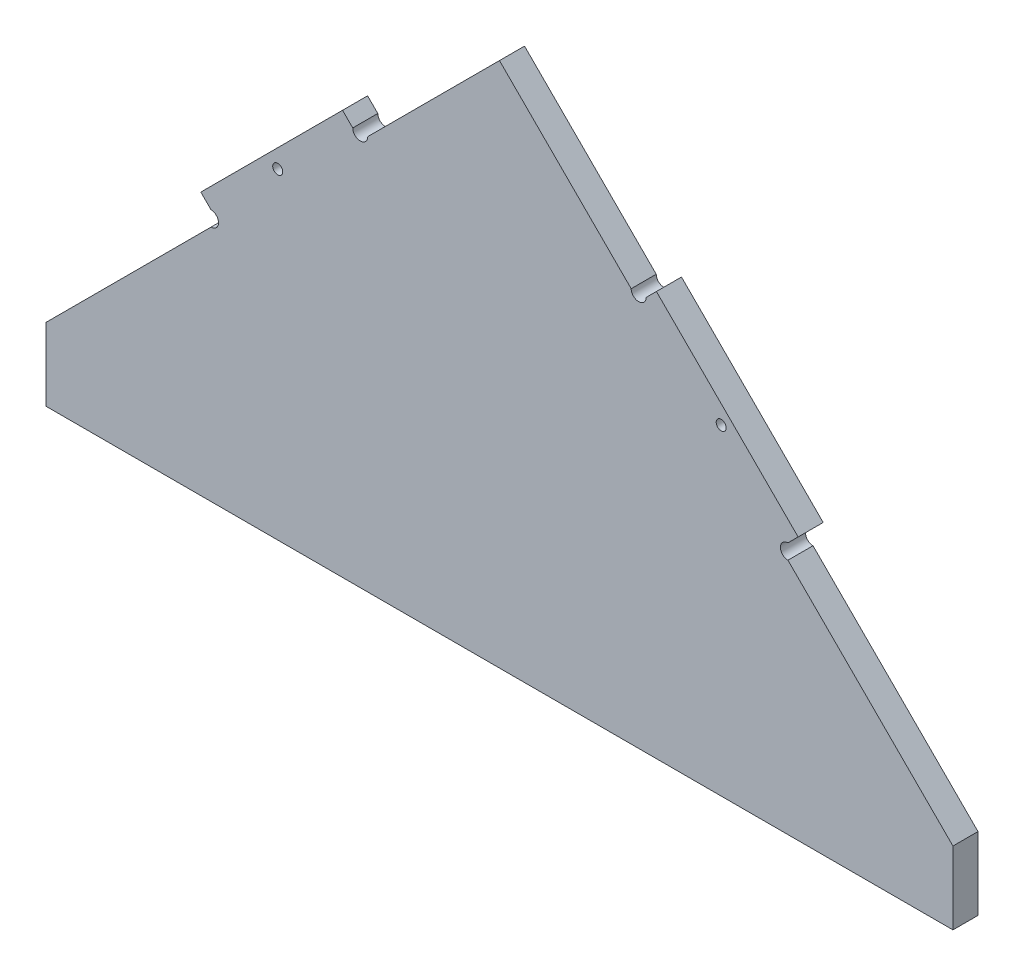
ISO-10303-21;
HEADER;
FILE_DESCRIPTION(('STEP AP214'),'2;1');
FILE_NAME('part.step','',(''),(''),'','','');
FILE_SCHEMA(('AUTOMOTIVE_DESIGN { 1 0 10303 214 1 1 1 1 }'));
ENDSEC;
DATA;
#1=APPLICATION_CONTEXT('core data for automotive mechanical design processes');
#2=APPLICATION_PROTOCOL_DEFINITION('international standard','automotive_design',2000,#1);
#3=PRODUCT_CONTEXT('',#1,'mechanical');
#4=PRODUCT('Part','Part','',(#3));
#5=PRODUCT_RELATED_PRODUCT_CATEGORY('part','',(#4));
#6=PRODUCT_DEFINITION_FORMATION('','',#4);
#7=PRODUCT_DEFINITION_CONTEXT('part definition',#1,'design');
#8=PRODUCT_DEFINITION('design','',#6,#7);
#9=PRODUCT_DEFINITION_SHAPE('','',#8);
#10=(LENGTH_UNIT() NAMED_UNIT(*) SI_UNIT(.MILLI.,.METRE.));
#11=(NAMED_UNIT(*) PLANE_ANGLE_UNIT() SI_UNIT($,.RADIAN.));
#12=(NAMED_UNIT(*) SI_UNIT($,.STERADIAN.) SOLID_ANGLE_UNIT());
#13=UNCERTAINTY_MEASURE_WITH_UNIT(LENGTH_MEASURE(1.E-05),#10,'distance_accuracy_value','');
#14=(GEOMETRIC_REPRESENTATION_CONTEXT(3) GLOBAL_UNCERTAINTY_ASSIGNED_CONTEXT((#13)) GLOBAL_UNIT_ASSIGNED_CONTEXT((#10,
#11,#12)) REPRESENTATION_CONTEXT('',''));
#15=CARTESIAN_POINT('',(0.,0.,0.));
#16=DIRECTION('',(0.,0.,1.));
#17=DIRECTION('',(1.,0.,0.));
#18=AXIS2_PLACEMENT_3D('',#15,#16,#17);
#19=CARTESIAN_POINT('',(-57.568542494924,48.9314575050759,5.));
#20=DIRECTION('',(0.,0.,-1.));
#21=DIRECTION('',(-1.,0.,0.));
#22=AXIS2_PLACEMENT_3D('',#19,#20,#21);
#23=PLANE('',#22);
#24=CARTESIAN_POINT('',(-44.2533933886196,64.1223634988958,5.));
#25=DIRECTION('',(0.,0.,1.));
#26=DIRECTION('',(-1.,0.,0.));
#27=AXIS2_PLACEMENT_3D('',#24,#25,#26);
#28=CIRCLE('',#27,1.00000000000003);
#29=CARTESIAN_POINT('',(-45.2533933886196,64.1223634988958,5.));
#30=VERTEX_POINT('',#29);
#31=EDGE_CURVE('E187',#30,#30,#28,.T.);
#32=ORIENTED_EDGE('',*,*,#31,.F.);
#33=EDGE_LOOP('',(#32));
#34=FACE_BOUND('',#33,.T.);
#35=DIRECTION('',(-0.707106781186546,0.707106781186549,0.));
#36=VECTOR('',#35,1.);
#37=CARTESIAN_POINT('',(-29.2842712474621,78.7157287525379,5.));
#38=LINE('',#37,#36);
#39=CARTESIAN_POINT('',(-29.2842712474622,78.7157287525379,5.));
#40=VERTEX_POINT('',#39);
#41=CARTESIAN_POINT('',(-31.3198051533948,80.7512626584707,5.));
#42=VERTEX_POINT('',#41);
#43=EDGE_CURVE('E216',#40,#42,#38,.T.);
#44=ORIENTED_EDGE('',*,*,#43,.T.);
#45=DIRECTION('',(-0.707106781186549,-0.707106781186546,0.));
#46=VECTOR('',#45,1.);
#47=CARTESIAN_POINT('',(-31.3198051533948,80.7512626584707,5.));
#48=LINE('',#47,#46);
#49=CARTESIAN_POINT('',(-59.6040764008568,52.4669914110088,5.));
#50=VERTEX_POINT('',#49);
#51=EDGE_CURVE('E119',#42,#50,#48,.T.);
#52=ORIENTED_EDGE('',*,*,#51,.T.);
#53=DIRECTION('',(0.70710678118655,-0.707106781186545,0.));
#54=VECTOR('',#53,1.);
#55=CARTESIAN_POINT('',(-59.6040764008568,52.4669914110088,5.));
#56=LINE('',#55,#54);
#57=CARTESIAN_POINT('',(-57.5685424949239,50.4314575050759,5.));
#58=VERTEX_POINT('',#57);
#59=EDGE_CURVE('E258',#50,#58,#56,.T.);
#60=ORIENTED_EDGE('',*,*,#59,.T.);
#61=CARTESIAN_POINT('',(-57.568542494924,48.9314575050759,5.));
#62=DIRECTION('',(0.,0.,-1.));
#63=DIRECTION('',(-1.,0.,0.));
#64=AXIS2_PLACEMENT_3D('',#61,#62,#63);
#65=CIRCLE('',#64,1.5);
#66=CARTESIAN_POINT('',(-57.568542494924,47.4314575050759,5.));
#67=VERTEX_POINT('',#66);
#68=EDGE_CURVE('E277',#58,#67,#65,.T.);
#69=ORIENTED_EDGE('',*,*,#68,.T.);
#70=DIRECTION('',(-0.70710678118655,-0.707106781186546,0.));
#71=VECTOR('',#70,1.);
#72=CARTESIAN_POINT('',(-90.5,14.5,5.));
#73=LINE('',#72,#71);
#74=CARTESIAN_POINT('',(-90.5,14.5,5.));
#75=VERTEX_POINT('',#74);
#76=EDGE_CURVE('E274',#67,#75,#73,.T.);
#77=ORIENTED_EDGE('',*,*,#76,.T.);
#78=DIRECTION('',(0.,-1.,0.));
#79=VECTOR('',#78,1.);
#80=CARTESIAN_POINT('',(-90.5,0.,5.));
#81=LINE('',#80,#79);
#82=CARTESIAN_POINT('',(-90.5,0.,5.));
#83=VERTEX_POINT('',#82);
#84=EDGE_CURVE('E276',#75,#83,#81,.T.);
#85=ORIENTED_EDGE('',*,*,#84,.T.);
#86=DIRECTION('',(1.,0.,0.));
#87=VECTOR('',#86,1.);
#88=CARTESIAN_POINT('',(90.5,0.,5.));
#89=LINE('',#88,#87);
#90=CARTESIAN_POINT('',(90.5,0.,5.));
#91=VERTEX_POINT('',#90);
#92=EDGE_CURVE('E279',#83,#91,#89,.T.);
#93=ORIENTED_EDGE('',*,*,#92,.T.);
#94=DIRECTION('',(0.,1.,0.));
#95=VECTOR('',#94,1.);
#96=CARTESIAN_POINT('',(90.5,0.,5.));
#97=LINE('',#96,#95);
#98=CARTESIAN_POINT('',(90.5000000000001,14.5,5.));
#99=VERTEX_POINT('',#98);
#100=EDGE_CURVE('E285',#91,#99,#97,.T.);
#101=ORIENTED_EDGE('',*,*,#100,.T.);
#102=DIRECTION('',(-0.70710678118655,0.707106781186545,0.));
#103=VECTOR('',#102,1.);
#104=CARTESIAN_POINT('',(90.5000000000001,14.5,5.));
#105=LINE('',#104,#103);
#106=CARTESIAN_POINT('',(57.568542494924,47.4314575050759,5.));
#107=VERTEX_POINT('',#106);
#108=EDGE_CURVE('E287',#99,#107,#105,.T.);
#109=ORIENTED_EDGE('',*,*,#108,.T.);
#110=CARTESIAN_POINT('',(57.568542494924,48.9314575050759,5.));
#111=DIRECTION('',(0.,0.,-1.));
#112=DIRECTION('',(1.,0.,0.));
#113=AXIS2_PLACEMENT_3D('',#110,#111,#112);
#114=CIRCLE('',#113,1.5);
#115=CARTESIAN_POINT('',(57.5685424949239,50.4314575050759,5.));
#116=VERTEX_POINT('',#115);
#117=EDGE_CURVE('E289',#107,#116,#114,.T.);
#118=ORIENTED_EDGE('',*,*,#117,.T.);
#119=DIRECTION('',(0.707106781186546,0.707106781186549,0.));
#120=VECTOR('',#119,1.);
#121=CARTESIAN_POINT('',(59.6040764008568,52.4669914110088,5.));
#122=LINE('',#121,#120);
#123=CARTESIAN_POINT('',(59.6040764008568,52.4669914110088,5.));
#124=VERTEX_POINT('',#123);
#125=EDGE_CURVE('E291',#116,#124,#122,.T.);
#126=ORIENTED_EDGE('',*,*,#125,.T.);
#127=DIRECTION('',(-0.707106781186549,0.707106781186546,0.));
#128=VECTOR('',#127,1.);
#129=CARTESIAN_POINT('',(31.3198051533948,80.7512626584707,5.));
#130=LINE('',#129,#128);
#131=CARTESIAN_POINT('',(31.3198051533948,80.7512626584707,5.));
#132=VERTEX_POINT('',#131);
#133=EDGE_CURVE('E293',#124,#132,#130,.T.);
#134=ORIENTED_EDGE('',*,*,#133,.T.);
#135=DIRECTION('',(-0.707106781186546,-0.707106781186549,0.));
#136=VECTOR('',#135,1.);
#137=CARTESIAN_POINT('',(29.2842712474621,78.7157287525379,5.));
#138=LINE('',#137,#136);
#139=CARTESIAN_POINT('',(29.2842712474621,78.7157287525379,5.));
#140=VERTEX_POINT('',#139);
#141=EDGE_CURVE('E295',#132,#140,#138,.T.);
#142=ORIENTED_EDGE('',*,*,#141,.T.);
#143=CARTESIAN_POINT('',(27.784271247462,78.7157287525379,5.));
#144=DIRECTION('',(0.,0.,-1.));
#145=DIRECTION('',(1.,0.,0.));
#146=AXIS2_PLACEMENT_3D('',#143,#144,#145);
#147=CIRCLE('',#146,1.50000000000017);
#148=CARTESIAN_POINT('',(26.2842712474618,78.7157287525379,5.));
#149=VERTEX_POINT('',#148);
#150=EDGE_CURVE('E165',#140,#149,#147,.T.);
#151=ORIENTED_EDGE('',*,*,#150,.T.);
#152=DIRECTION('',(-0.70710678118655,0.707106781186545,0.));
#153=VECTOR('',#152,1.);
#154=CARTESIAN_POINT('',(26.2842712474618,78.7157287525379,5.));
#155=LINE('',#154,#153);
#156=CARTESIAN_POINT('',(0.,105.,5.));
#157=VERTEX_POINT('',#156);
#158=EDGE_CURVE('E159',#149,#157,#155,.T.);
#159=ORIENTED_EDGE('',*,*,#158,.T.);
#160=DIRECTION('',(-0.707106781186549,-0.707106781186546,0.));
#161=VECTOR('',#160,1.);
#162=CARTESIAN_POINT('',(-26.2842712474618,78.7157287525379,5.));
#163=LINE('',#162,#161);
#164=CARTESIAN_POINT('',(-26.2842712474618,78.7157287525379,5.));
#165=VERTEX_POINT('',#164);
#166=EDGE_CURVE('E163',#157,#165,#163,.T.);
#167=ORIENTED_EDGE('',*,*,#166,.T.);
#168=CARTESIAN_POINT('',(-27.784271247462,78.7157287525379,5.));
#169=DIRECTION('',(0.,0.,-1.));
#170=DIRECTION('',(-1.,0.,0.));
#171=AXIS2_PLACEMENT_3D('',#168,#169,#170);
#172=CIRCLE('',#171,1.50000000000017);
#173=EDGE_CURVE('E49',#165,#40,#172,.T.);
#174=ORIENTED_EDGE('',*,*,#173,.T.);
#175=EDGE_LOOP('',(#44,#52,#60,#69,#77,#85,#93,#101,#109,#118,#126,#134,#142,#151,#159,#167,#174));
#176=FACE_BOUND('',#175,.T.);
#177=CARTESIAN_POINT('',(44.2533933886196,64.1223634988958,5.));
#178=DIRECTION('',(0.,0.,1.));
#179=DIRECTION('',(1.,0.,0.));
#180=AXIS2_PLACEMENT_3D('',#177,#178,#179);
#181=CIRCLE('',#180,1.00000000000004);
#182=CARTESIAN_POINT('',(45.2533933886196,64.1223634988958,5.));
#183=VERTEX_POINT('',#182);
#184=EDGE_CURVE('E338',#183,#183,#181,.T.);
#185=ORIENTED_EDGE('',*,*,#184,.F.);
#186=EDGE_LOOP('',(#185));
#187=FACE_BOUND('',#186,.T.);
#188=ADVANCED_FACE('F32',(#34,#176,#187),#23,.F.);
#189=CARTESIAN_POINT('',(-57.568542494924,48.9314575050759,0.));
#190=DIRECTION('',(0.,0.,-1.));
#191=DIRECTION('',(-1.,0.,0.));
#192=AXIS2_PLACEMENT_3D('',#189,#190,#191);
#193=PLANE('',#192);
#194=CARTESIAN_POINT('',(-44.2533933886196,64.1223634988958,0.));
#195=DIRECTION('',(0.,0.,1.));
#196=DIRECTION('',(-1.,0.,0.));
#197=AXIS2_PLACEMENT_3D('',#194,#195,#196);
#198=CIRCLE('',#197,1.00000000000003);
#199=CARTESIAN_POINT('',(-45.2533933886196,64.1223634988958,0.));
#200=VERTEX_POINT('',#199);
#201=EDGE_CURVE('E343',#200,#200,#198,.T.);
#202=ORIENTED_EDGE('',*,*,#201,.T.);
#203=EDGE_LOOP('',(#202));
#204=FACE_BOUND('',#203,.T.);
#205=DIRECTION('',(-0.707106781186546,0.707106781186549,0.));
#206=VECTOR('',#205,1.);
#207=CARTESIAN_POINT('',(-29.2842712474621,78.7157287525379,0.));
#208=LINE('',#207,#206);
#209=CARTESIAN_POINT('',(-29.2842712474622,78.7157287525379,0.));
#210=VERTEX_POINT('',#209);
#211=CARTESIAN_POINT('',(-31.3198051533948,80.7512626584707,0.));
#212=VERTEX_POINT('',#211);
#213=EDGE_CURVE('E183',#210,#212,#208,.T.);
#214=ORIENTED_EDGE('',*,*,#213,.F.);
#215=CARTESIAN_POINT('',(-27.784271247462,78.7157287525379,0.));
#216=DIRECTION('',(0.,0.,-1.));
#217=DIRECTION('',(-1.,0.,0.));
#218=AXIS2_PLACEMENT_3D('',#215,#216,#217);
#219=CIRCLE('',#218,1.50000000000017);
#220=CARTESIAN_POINT('',(-26.2842712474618,78.7157287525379,0.));
#221=VERTEX_POINT('',#220);
#222=EDGE_CURVE('E111',#221,#210,#219,.T.);
#223=ORIENTED_EDGE('',*,*,#222,.F.);
#224=DIRECTION('',(-0.707106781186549,-0.707106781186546,0.));
#225=VECTOR('',#224,1.);
#226=CARTESIAN_POINT('',(-26.2842712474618,78.7157287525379,0.));
#227=LINE('',#226,#225);
#228=CARTESIAN_POINT('',(0.,105.,0.));
#229=VERTEX_POINT('',#228);
#230=EDGE_CURVE('E105',#229,#221,#227,.T.);
#231=ORIENTED_EDGE('',*,*,#230,.F.);
#232=DIRECTION('',(-0.70710678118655,0.707106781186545,0.));
#233=VECTOR('',#232,1.);
#234=CARTESIAN_POINT('',(26.2842712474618,78.7157287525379,0.));
#235=LINE('',#234,#233);
#236=CARTESIAN_POINT('',(26.2842712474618,78.7157287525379,0.));
#237=VERTEX_POINT('',#236);
#238=EDGE_CURVE('E173',#237,#229,#235,.T.);
#239=ORIENTED_EDGE('',*,*,#238,.F.);
#240=CARTESIAN_POINT('',(27.784271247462,78.7157287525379,0.));
#241=DIRECTION('',(0.,0.,-1.));
#242=DIRECTION('',(1.,0.,0.));
#243=AXIS2_PLACEMENT_3D('',#240,#241,#242);
#244=CIRCLE('',#243,1.50000000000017);
#245=CARTESIAN_POINT('',(29.2842712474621,78.7157287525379,0.));
#246=VERTEX_POINT('',#245);
#247=EDGE_CURVE('E211',#246,#237,#244,.T.);
#248=ORIENTED_EDGE('',*,*,#247,.F.);
#249=DIRECTION('',(-0.707106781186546,-0.707106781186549,0.));
#250=VECTOR('',#249,1.);
#251=CARTESIAN_POINT('',(29.2842712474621,78.7157287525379,0.));
#252=LINE('',#251,#250);
#253=CARTESIAN_POINT('',(31.3198051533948,80.7512626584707,0.));
#254=VERTEX_POINT('',#253);
#255=EDGE_CURVE('E209',#254,#246,#252,.T.);
#256=ORIENTED_EDGE('',*,*,#255,.F.);
#257=DIRECTION('',(-0.707106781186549,0.707106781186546,0.));
#258=VECTOR('',#257,1.);
#259=CARTESIAN_POINT('',(31.3198051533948,80.7512626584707,0.));
#260=LINE('',#259,#258);
#261=CARTESIAN_POINT('',(59.6040764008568,52.4669914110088,0.));
#262=VERTEX_POINT('',#261);
#263=EDGE_CURVE('E207',#262,#254,#260,.T.);
#264=ORIENTED_EDGE('',*,*,#263,.F.);
#265=DIRECTION('',(0.707106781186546,0.707106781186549,0.));
#266=VECTOR('',#265,1.);
#267=CARTESIAN_POINT('',(59.6040764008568,52.4669914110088,0.));
#268=LINE('',#267,#266);
#269=CARTESIAN_POINT('',(57.5685424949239,50.4314575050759,0.));
#270=VERTEX_POINT('',#269);
#271=EDGE_CURVE('E205',#270,#262,#268,.T.);
#272=ORIENTED_EDGE('',*,*,#271,.F.);
#273=CARTESIAN_POINT('',(57.568542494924,48.9314575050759,0.));
#274=DIRECTION('',(0.,0.,-1.));
#275=DIRECTION('',(1.,0.,0.));
#276=AXIS2_PLACEMENT_3D('',#273,#274,#275);
#277=CIRCLE('',#276,1.5);
#278=CARTESIAN_POINT('',(57.568542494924,47.4314575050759,0.));
#279=VERTEX_POINT('',#278);
#280=EDGE_CURVE('E203',#279,#270,#277,.T.);
#281=ORIENTED_EDGE('',*,*,#280,.F.);
#282=DIRECTION('',(-0.70710678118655,0.707106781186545,0.));
#283=VECTOR('',#282,1.);
#284=CARTESIAN_POINT('',(90.5000000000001,14.5,0.));
#285=LINE('',#284,#283);
#286=CARTESIAN_POINT('',(90.5000000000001,14.5,0.));
#287=VERTEX_POINT('',#286);
#288=EDGE_CURVE('E201',#287,#279,#285,.T.);
#289=ORIENTED_EDGE('',*,*,#288,.F.);
#290=DIRECTION('',(0.,1.,0.));
#291=VECTOR('',#290,1.);
#292=CARTESIAN_POINT('',(90.5,0.,0.));
#293=LINE('',#292,#291);
#294=CARTESIAN_POINT('',(90.5,0.,0.));
#295=VERTEX_POINT('',#294);
#296=EDGE_CURVE('E199',#295,#287,#293,.T.);
#297=ORIENTED_EDGE('',*,*,#296,.F.);
#298=DIRECTION('',(1.,0.,0.));
#299=VECTOR('',#298,1.);
#300=CARTESIAN_POINT('',(90.5,0.,0.));
#301=LINE('',#300,#299);
#302=CARTESIAN_POINT('',(-90.5,0.,0.));
#303=VERTEX_POINT('',#302);
#304=EDGE_CURVE('E197',#303,#295,#301,.T.);
#305=ORIENTED_EDGE('',*,*,#304,.F.);
#306=DIRECTION('',(0.,-1.,0.));
#307=VECTOR('',#306,1.);
#308=CARTESIAN_POINT('',(-90.5,0.,0.));
#309=LINE('',#308,#307);
#310=CARTESIAN_POINT('',(-90.5,14.5,0.));
#311=VERTEX_POINT('',#310);
#312=EDGE_CURVE('E195',#311,#303,#309,.T.);
#313=ORIENTED_EDGE('',*,*,#312,.F.);
#314=DIRECTION('',(-0.70710678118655,-0.707106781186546,0.));
#315=VECTOR('',#314,1.);
#316=CARTESIAN_POINT('',(-90.5,14.5,0.));
#317=LINE('',#316,#315);
#318=CARTESIAN_POINT('',(-57.568542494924,47.4314575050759,0.));
#319=VERTEX_POINT('',#318);
#320=EDGE_CURVE('E193',#319,#311,#317,.T.);
#321=ORIENTED_EDGE('',*,*,#320,.F.);
#322=CARTESIAN_POINT('',(-57.568542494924,48.9314575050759,0.));
#323=DIRECTION('',(0.,0.,-1.));
#324=DIRECTION('',(-1.,0.,0.));
#325=AXIS2_PLACEMENT_3D('',#322,#323,#324);
#326=CIRCLE('',#325,1.5);
#327=CARTESIAN_POINT('',(-57.5685424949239,50.4314575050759,0.));
#328=VERTEX_POINT('',#327);
#329=EDGE_CURVE('E191',#328,#319,#326,.T.);
#330=ORIENTED_EDGE('',*,*,#329,.F.);
#331=DIRECTION('',(0.70710678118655,-0.707106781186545,0.));
#332=VECTOR('',#331,1.);
#333=CARTESIAN_POINT('',(-59.6040764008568,52.4669914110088,0.));
#334=LINE('',#333,#332);
#335=CARTESIAN_POINT('',(-59.6040764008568,52.4669914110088,0.));
#336=VERTEX_POINT('',#335);
#337=EDGE_CURVE('E189',#336,#328,#334,.T.);
#338=ORIENTED_EDGE('',*,*,#337,.F.);
#339=DIRECTION('',(-0.707106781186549,-0.707106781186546,0.));
#340=VECTOR('',#339,1.);
#341=CARTESIAN_POINT('',(-31.3198051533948,80.7512626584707,0.));
#342=LINE('',#341,#340);
#343=EDGE_CURVE('E186',#212,#336,#342,.T.);
#344=ORIENTED_EDGE('',*,*,#343,.F.);
#345=EDGE_LOOP('',(#214,#223,#231,#239,#248,#256,#264,#272,#281,#289,#297,#305,#313,#321,#330,
#338,#344));
#346=FACE_BOUND('',#345,.T.);
#347=CARTESIAN_POINT('',(44.2533933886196,64.1223634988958,0.));
#348=DIRECTION('',(0.,0.,1.));
#349=DIRECTION('',(1.,0.,0.));
#350=AXIS2_PLACEMENT_3D('',#347,#348,#349);
#351=CIRCLE('',#350,1.00000000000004);
#352=CARTESIAN_POINT('',(45.2533933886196,64.1223634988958,0.));
#353=VERTEX_POINT('',#352);
#354=EDGE_CURVE('E341',#353,#353,#351,.T.);
#355=ORIENTED_EDGE('',*,*,#354,.T.);
#356=EDGE_LOOP('',(#355));
#357=FACE_BOUND('',#356,.T.);
#358=ADVANCED_FACE('F262',(#204,#346,#357),#193,.T.);
#359=CARTESIAN_POINT('',(-29.2842712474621,78.7157287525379,5.));
#360=DIRECTION('',(-0.707106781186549,-0.707106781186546,0.));
#361=DIRECTION('',(0.707106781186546,-0.707106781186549,0.));
#362=AXIS2_PLACEMENT_3D('',#359,#360,#361);
#363=PLANE('',#362);
#364=ORIENTED_EDGE('',*,*,#213,.T.);
#365=DIRECTION('',(0.,0.,-1.));
#366=VECTOR('',#365,1.);
#367=CARTESIAN_POINT('',(-31.3198051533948,80.7512626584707,5.));
#368=LINE('',#367,#366);
#369=EDGE_CURVE('E11',#42,#212,#368,.T.);
#370=ORIENTED_EDGE('',*,*,#369,.F.);
#371=ORIENTED_EDGE('',*,*,#43,.F.);
#372=DIRECTION('',(0.,0.,-1.));
#373=VECTOR('',#372,1.);
#374=CARTESIAN_POINT('',(-29.2842712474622,78.7157287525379,5.));
#375=LINE('',#374,#373);
#376=EDGE_CURVE('E179',#40,#210,#375,.T.);
#377=ORIENTED_EDGE('',*,*,#376,.T.);
#378=EDGE_LOOP('',(#364,#370,#371,#377));
#379=FACE_BOUND('',#378,.T.);
#380=ADVANCED_FACE('F34',(#379),#363,.F.);
#381=CARTESIAN_POINT('',(-31.3198051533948,80.7512626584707,5.));
#382=DIRECTION('',(0.707106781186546,-0.707106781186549,0.));
#383=DIRECTION('',(0.707106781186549,0.707106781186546,0.));
#384=AXIS2_PLACEMENT_3D('',#381,#382,#383);
#385=PLANE('',#384);
#386=ORIENTED_EDGE('',*,*,#343,.T.);
#387=DIRECTION('',(0.,0.,-1.));
#388=VECTOR('',#387,1.);
#389=CARTESIAN_POINT('',(-59.6040764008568,52.4669914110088,5.));
#390=LINE('',#389,#388);
#391=EDGE_CURVE('E41',#50,#336,#390,.T.);
#392=ORIENTED_EDGE('',*,*,#391,.F.);
#393=ORIENTED_EDGE('',*,*,#51,.F.);
#394=ORIENTED_EDGE('',*,*,#369,.T.);
#395=EDGE_LOOP('',(#386,#392,#393,#394));
#396=FACE_BOUND('',#395,.T.);
#397=ADVANCED_FACE('F486',(#396),#385,.F.);
#398=CARTESIAN_POINT('',(-59.6040764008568,52.4669914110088,5.));
#399=DIRECTION('',(0.707106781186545,0.70710678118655,0.));
#400=DIRECTION('',(-0.70710678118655,0.707106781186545,0.));
#401=AXIS2_PLACEMENT_3D('',#398,#399,#400);
#402=PLANE('',#401);
#403=ORIENTED_EDGE('',*,*,#337,.T.);
#404=DIRECTION('',(0.,0.,-1.));
#405=VECTOR('',#404,1.);
#406=CARTESIAN_POINT('',(-57.5685424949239,50.4314575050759,5.));
#407=LINE('',#406,#405);
#408=EDGE_CURVE('E250',#58,#328,#407,.T.);
#409=ORIENTED_EDGE('',*,*,#408,.F.);
#410=ORIENTED_EDGE('',*,*,#59,.F.);
#411=ORIENTED_EDGE('',*,*,#391,.T.);
#412=EDGE_LOOP('',(#403,#409,#410,#411));
#413=FACE_BOUND('',#412,.T.);
#414=ADVANCED_FACE('F256',(#413),#402,.F.);
#415=CARTESIAN_POINT('',(-57.568542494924,48.9314575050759,5.));
#416=DIRECTION('',(0.,0.,-1.));
#417=DIRECTION('',(-1.,0.,0.));
#418=AXIS2_PLACEMENT_3D('',#415,#416,#417);
#419=CYLINDRICAL_SURFACE('',#418,1.5);
#420=ORIENTED_EDGE('',*,*,#329,.T.);
#421=DIRECTION('',(0.,0.,-1.));
#422=VECTOR('',#421,1.);
#423=CARTESIAN_POINT('',(-57.568542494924,47.4314575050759,5.));
#424=LINE('',#423,#422);
#425=EDGE_CURVE('E247',#67,#319,#424,.T.);
#426=ORIENTED_EDGE('',*,*,#425,.F.);
#427=ORIENTED_EDGE('',*,*,#68,.F.);
#428=ORIENTED_EDGE('',*,*,#408,.T.);
#429=EDGE_LOOP('',(#420,#426,#427,#428));
#430=FACE_BOUND('',#429,.T.);
#431=ADVANCED_FACE('F268',(#430),#419,.F.);
#432=CARTESIAN_POINT('',(-90.5,14.5,5.));
#433=DIRECTION('',(0.707106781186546,-0.70710678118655,0.));
#434=DIRECTION('',(0.70710678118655,0.707106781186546,0.));
#435=AXIS2_PLACEMENT_3D('',#432,#433,#434);
#436=PLANE('',#435);
#437=ORIENTED_EDGE('',*,*,#320,.T.);
#438=DIRECTION('',(0.,0.,-1.));
#439=VECTOR('',#438,1.);
#440=CARTESIAN_POINT('',(-90.5,14.5,5.));
#441=LINE('',#440,#439);
#442=EDGE_CURVE('E244',#75,#311,#441,.T.);
#443=ORIENTED_EDGE('',*,*,#442,.F.);
#444=ORIENTED_EDGE('',*,*,#76,.F.);
#445=ORIENTED_EDGE('',*,*,#425,.T.);
#446=EDGE_LOOP('',(#437,#443,#444,#445));
#447=FACE_BOUND('',#446,.T.);
#448=ADVANCED_FACE('F272',(#447),#436,.F.);
#449=CARTESIAN_POINT('',(-90.5,0.,5.));
#450=DIRECTION('',(1.,0.,0.));
#451=DIRECTION('',(0.,1.,0.));
#452=AXIS2_PLACEMENT_3D('',#449,#450,#451);
#453=PLANE('',#452);
#454=ORIENTED_EDGE('',*,*,#312,.T.);
#455=DIRECTION('',(0.,0.,-1.));
#456=VECTOR('',#455,1.);
#457=CARTESIAN_POINT('',(-90.5,0.,5.));
#458=LINE('',#457,#456);
#459=EDGE_CURVE('E241',#83,#303,#458,.T.);
#460=ORIENTED_EDGE('',*,*,#459,.F.);
#461=ORIENTED_EDGE('',*,*,#84,.F.);
#462=ORIENTED_EDGE('',*,*,#442,.T.);
#463=EDGE_LOOP('',(#454,#460,#461,#462));
#464=FACE_BOUND('',#463,.T.);
#465=ADVANCED_FACE('F451',(#464),#453,.F.);
#466=CARTESIAN_POINT('',(90.5,0.,5.));
#467=DIRECTION('',(0.,1.,0.));
#468=DIRECTION('',(-1.,0.,0.));
#469=AXIS2_PLACEMENT_3D('',#466,#467,#468);
#470=PLANE('',#469);
#471=ORIENTED_EDGE('',*,*,#304,.T.);
#472=DIRECTION('',(0.,0.,-1.));
#473=VECTOR('',#472,1.);
#474=CARTESIAN_POINT('',(90.5,0.,5.));
#475=LINE('',#474,#473);
#476=EDGE_CURVE('E238',#91,#295,#475,.T.);
#477=ORIENTED_EDGE('',*,*,#476,.F.);
#478=ORIENTED_EDGE('',*,*,#92,.F.);
#479=ORIENTED_EDGE('',*,*,#459,.T.);
#480=EDGE_LOOP('',(#471,#477,#478,#479));
#481=FACE_BOUND('',#480,.T.);
#482=ADVANCED_FACE('F441',(#481),#470,.F.);
#483=CARTESIAN_POINT('',(90.5,0.,5.));
#484=DIRECTION('',(-1.,0.,0.));
#485=DIRECTION('',(0.,-1.,0.));
#486=AXIS2_PLACEMENT_3D('',#483,#484,#485);
#487=PLANE('',#486);
#488=ORIENTED_EDGE('',*,*,#296,.T.);
#489=DIRECTION('',(0.,0.,-1.));
#490=VECTOR('',#489,1.);
#491=CARTESIAN_POINT('',(90.5000000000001,14.5,5.));
#492=LINE('',#491,#490);
#493=EDGE_CURVE('E235',#99,#287,#492,.T.);
#494=ORIENTED_EDGE('',*,*,#493,.F.);
#495=ORIENTED_EDGE('',*,*,#100,.F.);
#496=ORIENTED_EDGE('',*,*,#476,.T.);
#497=EDGE_LOOP('',(#488,#494,#495,#496));
#498=FACE_BOUND('',#497,.T.);
#499=ADVANCED_FACE('F431',(#498),#487,.F.);
#500=CARTESIAN_POINT('',(90.5000000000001,14.5,5.));
#501=DIRECTION('',(-0.707106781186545,-0.70710678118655,0.));
#502=DIRECTION('',(0.70710678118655,-0.707106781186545,0.));
#503=AXIS2_PLACEMENT_3D('',#500,#501,#502);
#504=PLANE('',#503);
#505=ORIENTED_EDGE('',*,*,#288,.T.);
#506=DIRECTION('',(0.,0.,-1.));
#507=VECTOR('',#506,1.);
#508=CARTESIAN_POINT('',(57.568542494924,47.4314575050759,5.));
#509=LINE('',#508,#507);
#510=EDGE_CURVE('E232',#107,#279,#509,.T.);
#511=ORIENTED_EDGE('',*,*,#510,.F.);
#512=ORIENTED_EDGE('',*,*,#108,.F.);
#513=ORIENTED_EDGE('',*,*,#493,.T.);
#514=EDGE_LOOP('',(#505,#511,#512,#513));
#515=FACE_BOUND('',#514,.T.);
#516=ADVANCED_FACE('F421',(#515),#504,.F.);
#517=CARTESIAN_POINT('',(57.568542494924,48.9314575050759,5.));
#518=DIRECTION('',(0.,0.,-1.));
#519=DIRECTION('',(-1.,0.,0.));
#520=AXIS2_PLACEMENT_3D('',#517,#518,#519);
#521=CYLINDRICAL_SURFACE('',#520,1.5);
#522=ORIENTED_EDGE('',*,*,#280,.T.);
#523=DIRECTION('',(0.,0.,-1.));
#524=VECTOR('',#523,1.);
#525=CARTESIAN_POINT('',(57.5685424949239,50.4314575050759,5.));
#526=LINE('',#525,#524);
#527=EDGE_CURVE('E229',#116,#270,#526,.T.);
#528=ORIENTED_EDGE('',*,*,#527,.F.);
#529=ORIENTED_EDGE('',*,*,#117,.F.);
#530=ORIENTED_EDGE('',*,*,#510,.T.);
#531=EDGE_LOOP('',(#522,#528,#529,#530));
#532=FACE_BOUND('',#531,.T.);
#533=ADVANCED_FACE('F411',(#532),#521,.F.);
#534=CARTESIAN_POINT('',(59.6040764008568,52.4669914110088,5.));
#535=DIRECTION('',(-0.707106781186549,0.707106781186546,0.));
#536=DIRECTION('',(-0.707106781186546,-0.707106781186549,0.));
#537=AXIS2_PLACEMENT_3D('',#534,#535,#536);
#538=PLANE('',#537);
#539=ORIENTED_EDGE('',*,*,#271,.T.);
#540=DIRECTION('',(0.,0.,-1.));
#541=VECTOR('',#540,1.);
#542=CARTESIAN_POINT('',(59.6040764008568,52.4669914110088,5.));
#543=LINE('',#542,#541);
#544=EDGE_CURVE('E226',#124,#262,#543,.T.);
#545=ORIENTED_EDGE('',*,*,#544,.F.);
#546=ORIENTED_EDGE('',*,*,#125,.F.);
#547=ORIENTED_EDGE('',*,*,#527,.T.);
#548=EDGE_LOOP('',(#539,#545,#546,#547));
#549=FACE_BOUND('',#548,.T.);
#550=ADVANCED_FACE('F401',(#549),#538,.F.);
#551=CARTESIAN_POINT('',(31.3198051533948,80.7512626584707,5.));
#552=DIRECTION('',(-0.707106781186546,-0.707106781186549,0.));
#553=DIRECTION('',(0.707106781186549,-0.707106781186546,0.));
#554=AXIS2_PLACEMENT_3D('',#551,#552,#553);
#555=PLANE('',#554);
#556=ORIENTED_EDGE('',*,*,#263,.T.);
#557=DIRECTION('',(0.,0.,-1.));
#558=VECTOR('',#557,1.);
#559=CARTESIAN_POINT('',(31.3198051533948,80.7512626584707,5.));
#560=LINE('',#559,#558);
#561=EDGE_CURVE('E223',#132,#254,#560,.T.);
#562=ORIENTED_EDGE('',*,*,#561,.F.);
#563=ORIENTED_EDGE('',*,*,#133,.F.);
#564=ORIENTED_EDGE('',*,*,#544,.T.);
#565=EDGE_LOOP('',(#556,#562,#563,#564));
#566=FACE_BOUND('',#565,.T.);
#567=ADVANCED_FACE('F392',(#566),#555,.F.);
#568=CARTESIAN_POINT('',(29.2842712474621,78.7157287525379,5.));
#569=DIRECTION('',(0.707106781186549,-0.707106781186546,0.));
#570=DIRECTION('',(0.707106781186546,0.707106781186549,0.));
#571=AXIS2_PLACEMENT_3D('',#568,#569,#570);
#572=PLANE('',#571);
#573=ORIENTED_EDGE('',*,*,#255,.T.);
#574=DIRECTION('',(0.,0.,-1.));
#575=VECTOR('',#574,1.);
#576=CARTESIAN_POINT('',(29.2842712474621,78.7157287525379,5.));
#577=LINE('',#576,#575);
#578=EDGE_CURVE('E220',#140,#246,#577,.T.);
#579=ORIENTED_EDGE('',*,*,#578,.F.);
#580=ORIENTED_EDGE('',*,*,#141,.F.);
#581=ORIENTED_EDGE('',*,*,#561,.T.);
#582=EDGE_LOOP('',(#573,#579,#580,#581));
#583=FACE_BOUND('',#582,.T.);
#584=ADVANCED_FACE('F301',(#583),#572,.F.);
#585=CARTESIAN_POINT('',(27.784271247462,78.7157287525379,5.));
#586=DIRECTION('',(0.,0.,-1.));
#587=DIRECTION('',(-1.,0.,0.));
#588=AXIS2_PLACEMENT_3D('',#585,#586,#587);
#589=CYLINDRICAL_SURFACE('',#588,1.50000000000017);
#590=ORIENTED_EDGE('',*,*,#247,.T.);
#591=DIRECTION('',(0.,0.,-1.));
#592=VECTOR('',#591,1.);
#593=CARTESIAN_POINT('',(26.2842712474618,78.7157287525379,5.));
#594=LINE('',#593,#592);
#595=EDGE_CURVE('E174',#149,#237,#594,.T.);
#596=ORIENTED_EDGE('',*,*,#595,.F.);
#597=ORIENTED_EDGE('',*,*,#150,.F.);
#598=ORIENTED_EDGE('',*,*,#578,.T.);
#599=EDGE_LOOP('',(#590,#596,#597,#598));
#600=FACE_BOUND('',#599,.T.);
#601=ADVANCED_FACE('F305',(#600),#589,.F.);
#602=CARTESIAN_POINT('',(26.2842712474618,78.7157287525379,5.));
#603=DIRECTION('',(-0.707106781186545,-0.70710678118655,0.));
#604=DIRECTION('',(0.70710678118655,-0.707106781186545,0.));
#605=AXIS2_PLACEMENT_3D('',#602,#603,#604);
#606=PLANE('',#605);
#607=ORIENTED_EDGE('',*,*,#238,.T.);
#608=DIRECTION('',(0.,0.,-1.));
#609=VECTOR('',#608,1.);
#610=CARTESIAN_POINT('',(0.,105.,5.));
#611=LINE('',#610,#609);
#612=EDGE_CURVE('E170',#157,#229,#611,.T.);
#613=ORIENTED_EDGE('',*,*,#612,.F.);
#614=ORIENTED_EDGE('',*,*,#158,.F.);
#615=ORIENTED_EDGE('',*,*,#595,.T.);
#616=EDGE_LOOP('',(#607,#613,#614,#615));
#617=FACE_BOUND('',#616,.T.);
#618=ADVANCED_FACE('F171',(#617),#606,.F.);
#619=CARTESIAN_POINT('',(-26.2842712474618,78.7157287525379,5.));
#620=DIRECTION('',(0.707106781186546,-0.707106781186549,0.));
#621=DIRECTION('',(0.707106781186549,0.707106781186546,0.));
#622=AXIS2_PLACEMENT_3D('',#619,#620,#621);
#623=PLANE('',#622);
#624=ORIENTED_EDGE('',*,*,#230,.T.);
#625=DIRECTION('',(0.,0.,-1.));
#626=VECTOR('',#625,1.);
#627=CARTESIAN_POINT('',(-26.2842712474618,78.7157287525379,5.));
#628=LINE('',#627,#626);
#629=EDGE_CURVE('E175',#165,#221,#628,.T.);
#630=ORIENTED_EDGE('',*,*,#629,.F.);
#631=ORIENTED_EDGE('',*,*,#166,.F.);
#632=ORIENTED_EDGE('',*,*,#612,.T.);
#633=EDGE_LOOP('',(#624,#630,#631,#632));
#634=FACE_BOUND('',#633,.T.);
#635=ADVANCED_FACE('F177',(#634),#623,.F.);
#636=CARTESIAN_POINT('',(-27.784271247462,78.7157287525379,5.));
#637=DIRECTION('',(0.,0.,-1.));
#638=DIRECTION('',(-1.,0.,0.));
#639=AXIS2_PLACEMENT_3D('',#636,#637,#638);
#640=CYLINDRICAL_SURFACE('',#639,1.50000000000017);
#641=ORIENTED_EDGE('',*,*,#222,.T.);
#642=ORIENTED_EDGE('',*,*,#376,.F.);
#643=ORIENTED_EDGE('',*,*,#173,.F.);
#644=ORIENTED_EDGE('',*,*,#629,.T.);
#645=EDGE_LOOP('',(#641,#642,#643,#644));
#646=FACE_BOUND('',#645,.T.);
#647=ADVANCED_FACE('F309',(#646),#640,.F.);
#648=CARTESIAN_POINT('',(-44.2533933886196,64.1223634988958,5.));
#649=DIRECTION('',(0.,0.,-1.));
#650=DIRECTION('',(-1.,0.,0.));
#651=AXIS2_PLACEMENT_3D('',#648,#649,#650);
#652=CYLINDRICAL_SURFACE('',#651,1.00000000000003);
#653=ORIENTED_EDGE('',*,*,#31,.T.);
#654=EDGE_LOOP('',(#653));
#655=FACE_BOUND('',#654,.T.);
#656=ORIENTED_EDGE('',*,*,#201,.F.);
#657=EDGE_LOOP('',(#656));
#658=FACE_BOUND('',#657,.T.);
#659=ADVANCED_FACE('F311',(#655,#658),#652,.F.);
#660=CARTESIAN_POINT('',(44.2533933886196,64.1223634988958,5.));
#661=DIRECTION('',(0.,0.,-1.));
#662=DIRECTION('',(-1.,0.,0.));
#663=AXIS2_PLACEMENT_3D('',#660,#661,#662);
#664=CYLINDRICAL_SURFACE('',#663,1.00000000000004);
#665=ORIENTED_EDGE('',*,*,#184,.T.);
#666=EDGE_LOOP('',(#665));
#667=FACE_BOUND('',#666,.T.);
#668=ORIENTED_EDGE('',*,*,#354,.F.);
#669=EDGE_LOOP('',(#668));
#670=FACE_BOUND('',#669,.T.);
#671=ADVANCED_FACE('F317',(#667,#670),#664,.F.);
#672=CLOSED_SHELL('',(#188,#358,#380,#397,#414,#431,#448,#465,#482,#499,#516,#533,#550,#567,
#584,#601,#618,#635,#647,#659,#671));
#673=MANIFOLD_SOLID_BREP('B2',#672);
#674=ADVANCED_BREP_SHAPE_REPRESENTATION('',(#18,#673),#14);
#675=SHAPE_DEFINITION_REPRESENTATION(#9,#674);
ENDSEC;
END-ISO-10303-21;
